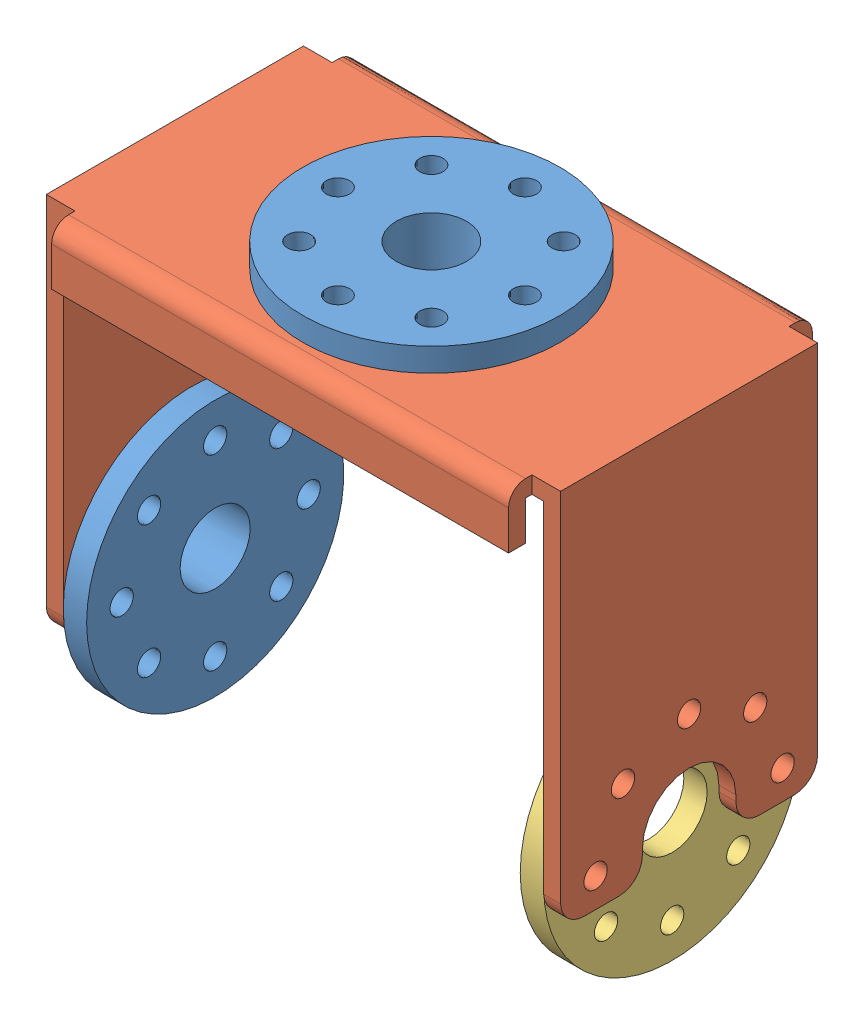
SolidWorks assembly Segment4.SLDASM, configuration Default (file format 8000). Lengths in mm.
Overall size (45.55 43 26).
4 component instances, 3 part files, 9 mates.
Components (placement in the parent):
- Disk_driver1-1: Disk_driver1.SLDPRT [Default] at origin size (5 22 22)
- Frame4-1: Frame4.SLDPRT [Default] at (41.55 13.7454 -0.0016) x (0 1 0) z (0 0 1) size (32.5 44 26)
- Disk1-1: Disk1.SLDPRT [Default] at (39.1 0 0) size (2 22 22)
- Disk_driver1-3: Disk_driver1.SLDPRT [Default] at (19.5 30.9954 -0.0016) x (0 1 0) z (1 0 0) size (5 22 22)
Mates (geometry in assembly coordinates):
- Concentric1: concentric aligned: cylinder of Disk_driver1-1 through (0 0 0) axis (-1 0 0) radius 3.75; cylinder of Disk1-1 through (39.1 0 0) axis (-1 0 0) radius 3
- Concentric2: concentric aligned: cylinder of Disk_driver1-1 through (0 0 0) axis (-1 0 0) radius 3.75; cylinder of Frame4-1 through (41.55 0 0) axis (-1 0 0) radius 4
- Coincident1: coincident anti-aligned: plane of Disk_driver1-1 through (-1 11 0) normal (-1 0 0); plane of Frame4-1 through (-1 28.5454 10.9984) normal (1 0 0)
- Concentric3: concentric aligned: cylinder of Disk_driver1-1 through (1 0 8) axis (-1 0 0) radius 1; cylinder of Frame4-1 through (41.55 0 8) axis (-1 0 0) radius 1
- Coincident2: coincident anti-aligned: plane of Frame4-1 through (40.1 -2.5046 10.9984) normal (-1 0 0); plane of Disk1-1 through (40.1 11 0) normal (1 0 0)
- Concentric4: concentric aligned: cylinder of Frame4-1 through (41.55 0 -8) axis (-1 0 0) radius 1; cylinder of Disk1-1 through (40.1 0 -8) axis (-1 0 0) radius 1
- Concentric6: concentric anti-aligned: cylinder of Frame4-1 through (19.5 -2.5 -0.0016) axis (0 1 0) radius 4; cylinder of Disk_driver1-3 through (19.5 30.9954 -0.0016) axis (0 -1 0) radius 3.75
- Coincident3: coincident anti-aligned: plane of Frame4-1 through (41.55 29.9954 10.9984) normal (0 1 0); plane of Disk_driver1-3 through (19.5 29.9954 10.9984) normal (0 -1 0)
- Parallel1: parallel anti-aligned: plane of Frame4-1 through (-6.2 28.5454 -13.0016) normal (0 0 -1); plane of Disk_driver1-3
